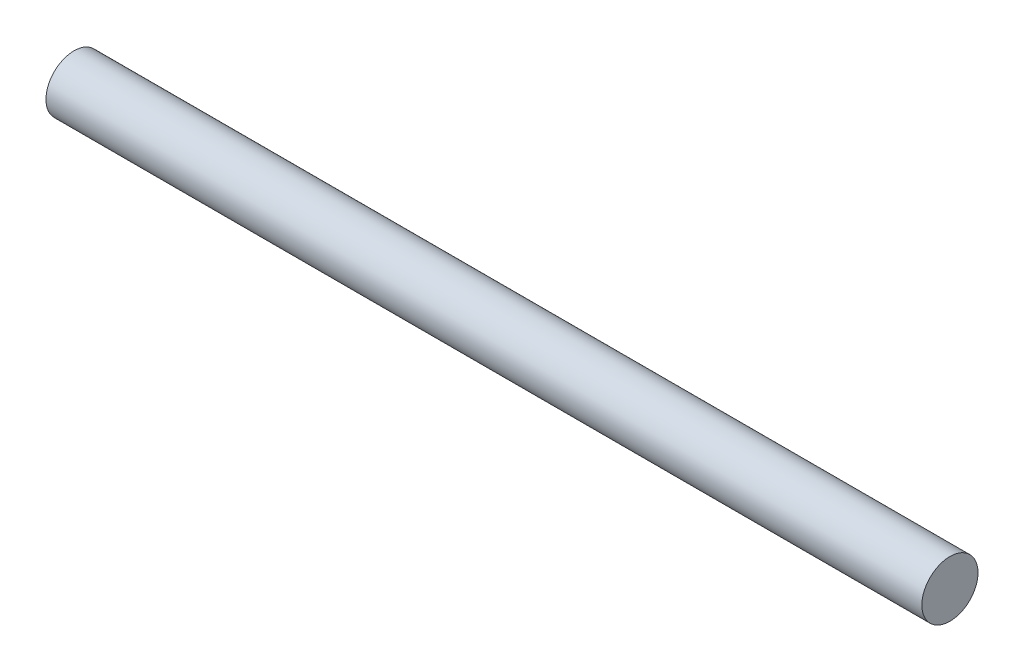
from build123d import *

# Parameters (mm, degrees)
SKETCH1_R              = 3.175
CIRCULAR_SECTION_DEPTH = 99.06


with BuildPart() as part:
    # Sketch1 → Circular_section (new body)
    with BuildSketch(Plane.YZ):
        with Locations(Location((0, 0, 0), (0, 0, 270))):
            Circle(SKETCH1_R)
    extrude(amount=CIRCULAR_SECTION_DEPTH)


solid = part.part
